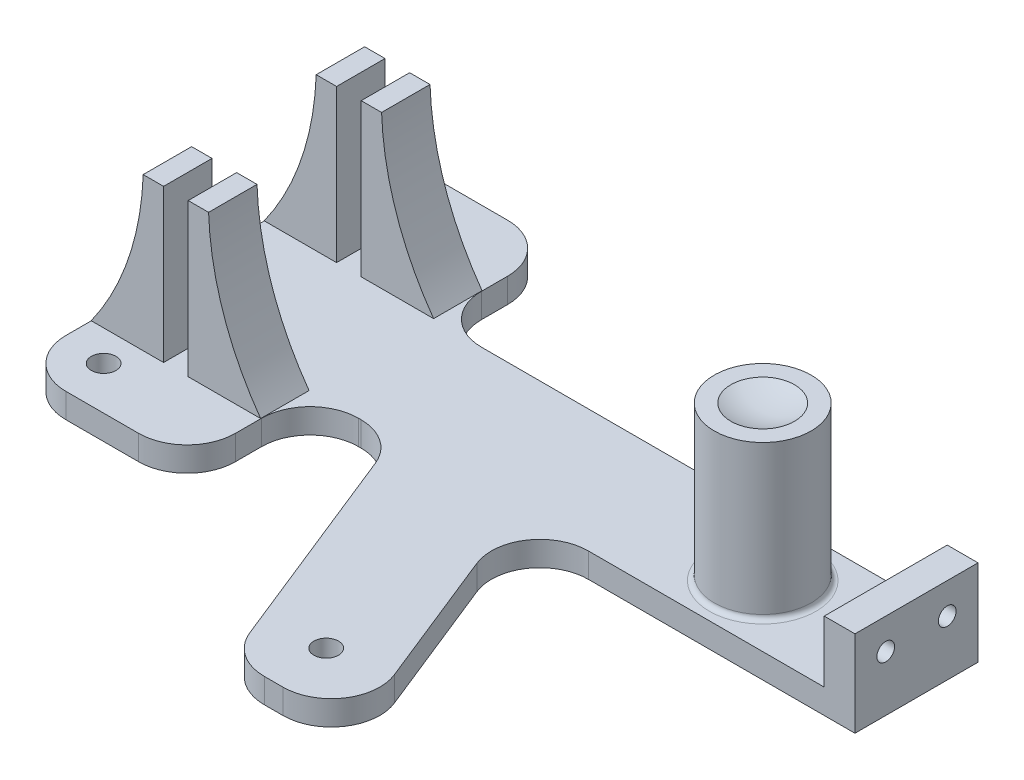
from build123d import *

# Parameters (mm, degrees)
BOSS_EXTRUDE1_DEPTH       = 5.08
BOSS_EXTRUDE2_DEPTH       = 10
SKETCH3_R                 = 10
BOSS_EXTRUDE3_DEPTH       = 31.75
FILLET1_R                 = 1
SKETCH9_W                 = 6.35
SKETCH9_H                 = 25.4
BOSS_EXTRUDE6_DEPTH       = 12.7
F_6_CLEARANCE_HOLE1_D     = 3.6576
F_6_CLEARANCE_HOLE1_DEPTH = 6.35
BOSS_EXTRUDE7_DEPTH       = 5.08
FILLET4_R                 = 10
FILLET5_R                 = 10
CUT_EXTRUDE1_REACH        = 155.752
SKETCH18_R                = 2.54


with BuildPart() as part:
    # Sketch1 → Boss-Extrude1 (new body)
    with BuildSketch(Plane(origin=(0, 0, 0), x_dir=(1, 0, 0), z_dir=(0, 1, 0))):
        with BuildLine():
            Line((20.08, 28.1), (20.08, 22.7))
            ThreePointArc((20.08, 22.7), (23.008932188, 15.628932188), (30.08, 12.7))
            Line((30.08, 12.7), (126.24, 12.7))
            Line((126.24, 12.7), (132.59, 12.7))
            Line((132.59, 12.7), (132.59, 0))
            Line((132.59, 0), (132.59, -12.7))
            Line((132.59, -12.7), (126.24, -12.7))
            Line((126.24, -12.7), (30.08, -12.7))
            ThreePointArc((30.08, -12.7), (23.008932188, -15.628932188), (20.08, -22.7))
            Line((20.08, -22.7), (20.08, -28.1))
            ThreePointArc((20.08, -28.1), (17.151067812, -35.171067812), (10.08, -38.1))
            Line((10.08, -38.1), (-4.92, -38.1))
            ThreePointArc((-4.92, -38.1), (-11.991067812, -35.171067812), (-14.92, -28.1))
            Line((-14.92, -28.1), (-14.92, 28.1))
            ThreePointArc((-14.92, 28.1), (-11.991067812, 35.171067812), (-4.92, 38.1))
            Line((-4.92, 38.1), (10.08, 38.1))
            ThreePointArc((10.08, 38.1), (17.151067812, 35.171067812), (20.08, 28.1))
        make_face()
    extrude(amount=-BOSS_EXTRUDE1_DEPTH)

    # Sketch2 → Boss-Extrude2 (add)
    with BuildSketch(Plane.XY.offset(22.86)):
        with BuildLine():
            Line((0, 0), (-14.953299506, 0))
            ThreePointArc((-14.953299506, 0), (-7.255141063, 14.95657571), (-4.209502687, 31.5))
            Line((-4.209502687, 31.5), (0, 31.5))
            Line((0, 31.5), (0, 0))
        make_face()
        with BuildLine():
            Line((5.08, 0), (20.033299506, 0))
            ThreePointArc((20.033299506, 0), (12.335141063, 14.95657571), (9.289502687, 31.5))
            Line((9.289502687, 31.5), (5.08, 31.5))
            Line((5.08, 31.5), (5.08, 0))
        make_face()
    boss_extrude2 = extrude(amount=-BOSS_EXTRUDE2_DEPTH)

    # Mirror1: Boss-Extrude2 across plane
    add(boss_extrude2.mirror(Plane.XY))

    # Sketch3 → Boss-Extrude3 (add)
    with BuildSketch(Plane(origin=(0, 0, 0), x_dir=(1, 0, 0), z_dir=(0, 1, 0))):
        with Locations(Location((100.84, 0, 0), (0, 0, 270))):
            Circle(SKETCH3_R)
    extrude(amount=BOSS_EXTRUDE3_DEPTH)

    # Fillet1
    fillet1_edges = [part.edges().sort_by_distance(p)[0] for p in [
        (100.84, 0, -10),
    ]]
    fillet(fillet1_edges, radius=FILLET1_R)

    # Sketch4 → Cut-Revolve1 (revolve, cut)
    with BuildSketch(Plane.XY):
        with BuildLine():
            Line((100.84, 31.75), (107.399510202, 31.75))
            ThreePointArc((107.399510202, 31.75), (104.189414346, 30.733638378), (100.84, 30.3884864))
            Line((100.84, 30.3884864), (100.84, 31.75))
        make_face()
    revolve(axis=Axis((100.84, 31.75, 0), (0, -1, 0)), mode=Mode.SUBTRACT)

    # Sketch9 → Boss-Extrude6 (add)
    with BuildSketch(Plane(origin=(0, 0, 0), x_dir=(1, 0, 0), z_dir=(0, 1, 0))):
        with Locations((129.415, 0)):
            Rectangle(SKETCH9_W, SKETCH9_H)
    extrude(amount=BOSS_EXTRUDE6_DEPTH)

    # 6 Clearance Hole1
    with Locations(Plane(origin=(132.59, 0, 0), x_dir=(0, 0, -1), z_dir=(1, 0, 0))):
        with Locations((6.35, 6.35), (-6.35, 6.35)):
            Hole(F_6_CLEARANCE_HOLE1_D / 2, depth=F_6_CLEARANCE_HOLE1_DEPTH)

    # Sketch17 → Boss-Extrude7 (add)
    with BuildSketch(Plane(origin=(0, 0, 0), x_dir=(1, 0, 0), z_dir=(0, 1, 0))):
        with BuildLine():
            Line((37.34, -12.7), (57.230452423, -62.301920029))
            ThreePointArc((57.230452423, -62.301920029), (60.909296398, -66.863091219), (66.512010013, -68.58))
            Line((66.512010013, -68.58), (70.36390259, -68.58))
            ThreePointArc((70.36390259, -68.58), (78.646993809, -64.182713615), (79.64546018, -54.858079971))
            Line((79.64546018, -54.858079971), (62.74, -12.7))
            Line((62.74, -12.7), (37.34, -12.7))
        make_face()
    extrude(amount=-BOSS_EXTRUDE7_DEPTH)

    # Fillet4
    fillet4_edges = [part.edges().sort_by_distance(p)[0] for p in [
        (62.74, -2.54, 12.7),
    ]]
    fillet(fillet4_edges, radius=FILLET4_R)

    # Fillet5
    fillet5_edges = [part.edges().sort_by_distance(p)[0] for p in [
        (37.34, -2.54, 12.7),
    ]]
    fillet(fillet5_edges, radius=FILLET5_R)

    # Sketch18 → Cut-Extrude1 (cut, up to next)
    with BuildSketch(Plane.XZ.offset(5.08), mode=Mode.PRIVATE) as cut_extrude1_sk1:
        with Locations(Location((-6.03, 29.21, 0), (0, 0, 270))):
            Circle(SKETCH18_R)
    cut_extrude1_tool1 = extrude(cut_extrude1_sk1.sketch, amount=-CUT_EXTRUDE1_REACH, mode=Mode.PRIVATE) & part.part
    # Sketch18 → Cut-Extrude1 (cut, up to next)
    with BuildSketch(Plane.XZ.offset(5.08), mode=Mode.PRIVATE) as cut_extrude1_sk2:
        with Locations(Location((-6.03, -29.21, 0), (0, 0, 90))):
            Circle(SKETCH18_R)
    cut_extrude1_tool2 = extrude(cut_extrude1_sk2.sketch, amount=-CUT_EXTRUDE1_REACH, mode=Mode.PRIVATE) & part.part
    # Sketch18 → Cut-Extrude1 (cut, up to next)
    with BuildSketch(Plane.XZ.offset(5.08), mode=Mode.PRIVATE) as cut_extrude1_sk3:
        with Locations(Location((67.864523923, 57.15, 0), (0, 0, 270))):
            Circle(SKETCH18_R)
    cut_extrude1_tool3 = extrude(cut_extrude1_sk3.sketch, amount=-CUT_EXTRUDE1_REACH, mode=Mode.PRIVATE) & part.part
    # Sketch18 → Cut-Extrude1 (cut, up to next)
    with BuildSketch(Plane.XZ.offset(5.08), mode=Mode.PRIVATE) as cut_extrude1_sk4:
        with Locations(Location((118.62, 0, 0), (0, 0, 270))):
            Circle(SKETCH18_R)
    cut_extrude1_tool4 = extrude(cut_extrude1_sk4.sketch, amount=-CUT_EXTRUDE1_REACH, mode=Mode.PRIVATE) & part.part
    add(cut_extrude1_tool1.solids().sort_by_distance((-6.03, -5.08, 29.21))[0], mode=Mode.SUBTRACT)
    add(cut_extrude1_tool2.solids().sort_by_distance((-6.03, -5.08, -29.21))[0], mode=Mode.SUBTRACT)
    add(cut_extrude1_tool3.solids().sort_by_distance((67.864524, -5.08, 57.15))[0], mode=Mode.SUBTRACT)
    add(cut_extrude1_tool4.solids().sort_by_distance((118.62, -5.08, 0))[0], mode=Mode.SUBTRACT)


solid = part.part
